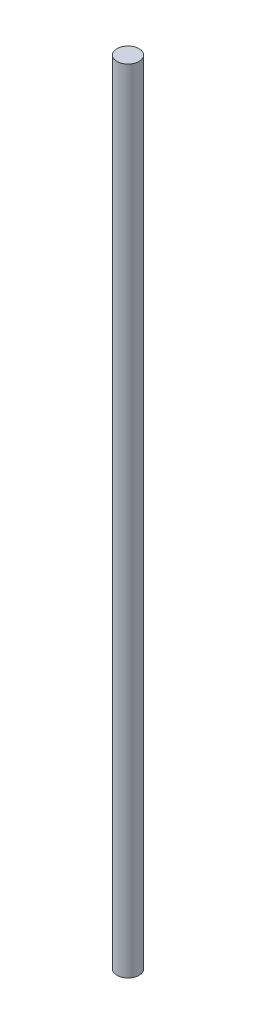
ISO-10303-21;
HEADER;
FILE_DESCRIPTION(('STEP AP214'),'2;1');
FILE_NAME('part.step','',(''),(''),'','','');
FILE_SCHEMA(('AUTOMOTIVE_DESIGN { 1 0 10303 214 1 1 1 1 }'));
ENDSEC;
DATA;
#1=APPLICATION_CONTEXT('core data for automotive mechanical design processes');
#2=APPLICATION_PROTOCOL_DEFINITION('international standard','automotive_design',2000,#1);
#3=PRODUCT_CONTEXT('',#1,'mechanical');
#4=PRODUCT('Part','Part','',(#3));
#5=PRODUCT_RELATED_PRODUCT_CATEGORY('part','',(#4));
#6=PRODUCT_DEFINITION_FORMATION('','',#4);
#7=PRODUCT_DEFINITION_CONTEXT('part definition',#1,'design');
#8=PRODUCT_DEFINITION('design','',#6,#7);
#9=PRODUCT_DEFINITION_SHAPE('','',#8);
#10=(LENGTH_UNIT() NAMED_UNIT(*) SI_UNIT(.MILLI.,.METRE.));
#11=(NAMED_UNIT(*) PLANE_ANGLE_UNIT() SI_UNIT($,.RADIAN.));
#12=(NAMED_UNIT(*) SI_UNIT($,.STERADIAN.) SOLID_ANGLE_UNIT());
#13=UNCERTAINTY_MEASURE_WITH_UNIT(LENGTH_MEASURE(1.E-05),#10,'distance_accuracy_value','');
#14=(GEOMETRIC_REPRESENTATION_CONTEXT(3) GLOBAL_UNCERTAINTY_ASSIGNED_CONTEXT((#13)) GLOBAL_UNIT_ASSIGNED_CONTEXT((#10,
#11,#12)) REPRESENTATION_CONTEXT('',''));
#15=CARTESIAN_POINT('',(0.,0.,0.));
#16=DIRECTION('',(0.,0.,1.));
#17=DIRECTION('',(1.,0.,0.));
#18=AXIS2_PLACEMENT_3D('',#15,#16,#17);
#19=CARTESIAN_POINT('',(0.,430.,0.));
#20=DIRECTION('',(0.,1.,0.));
#21=DIRECTION('',(0.,0.,1.));
#22=AXIS2_PLACEMENT_3D('',#19,#20,#21);
#23=PLANE('',#22);
#24=CARTESIAN_POINT('',(0.,430.,0.));
#25=DIRECTION('',(0.,-1.,0.));
#26=DIRECTION('',(0.,0.,-1.));
#27=AXIS2_PLACEMENT_3D('',#24,#25,#26);
#28=CIRCLE('',#27,6.);
#29=CARTESIAN_POINT('',(0.,430.,-6.));
#30=VERTEX_POINT('',#29);
#31=EDGE_CURVE('E18',#30,#30,#28,.T.);
#32=ORIENTED_EDGE('',*,*,#31,.F.);
#33=EDGE_LOOP('',(#32));
#34=FACE_BOUND('',#33,.T.);
#35=ADVANCED_FACE('F15',(#34),#23,.T.);
#36=CARTESIAN_POINT('',(0.,0.,0.));
#37=DIRECTION('',(0.,1.,0.));
#38=DIRECTION('',(0.,0.,1.));
#39=AXIS2_PLACEMENT_3D('',#36,#37,#38);
#40=PLANE('',#39);
#41=CARTESIAN_POINT('',(0.,0.,0.));
#42=DIRECTION('',(0.,-1.,0.));
#43=DIRECTION('',(0.,0.,-1.));
#44=AXIS2_PLACEMENT_3D('',#41,#42,#43);
#45=CIRCLE('',#44,6.);
#46=CARTESIAN_POINT('',(0.,0.,-6.));
#47=VERTEX_POINT('',#46);
#48=EDGE_CURVE('E10',#47,#47,#45,.F.);
#49=ORIENTED_EDGE('',*,*,#48,.F.);
#50=EDGE_LOOP('',(#49));
#51=FACE_BOUND('',#50,.T.);
#52=ADVANCED_FACE('F30',(#51),#40,.F.);
#53=CARTESIAN_POINT('',(0.,430.,0.));
#54=DIRECTION('',(0.,-1.,0.));
#55=DIRECTION('',(0.,0.,-1.));
#56=AXIS2_PLACEMENT_3D('',#53,#54,#55);
#57=CYLINDRICAL_SURFACE('',#56,6.);
#58=ORIENTED_EDGE('',*,*,#48,.T.);
#59=EDGE_LOOP('',(#58));
#60=FACE_BOUND('',#59,.T.);
#61=ORIENTED_EDGE('',*,*,#31,.T.);
#62=EDGE_LOOP('',(#61));
#63=FACE_BOUND('',#62,.T.);
#64=ADVANCED_FACE('F27',(#60,#63),#57,.T.);
#65=CLOSED_SHELL('',(#35,#52,#64));
#66=MANIFOLD_SOLID_BREP('B1',#65);
#67=ADVANCED_BREP_SHAPE_REPRESENTATION('',(#18,#66),#14);
#68=SHAPE_DEFINITION_REPRESENTATION(#9,#67);
ENDSEC;
END-ISO-10303-21;
